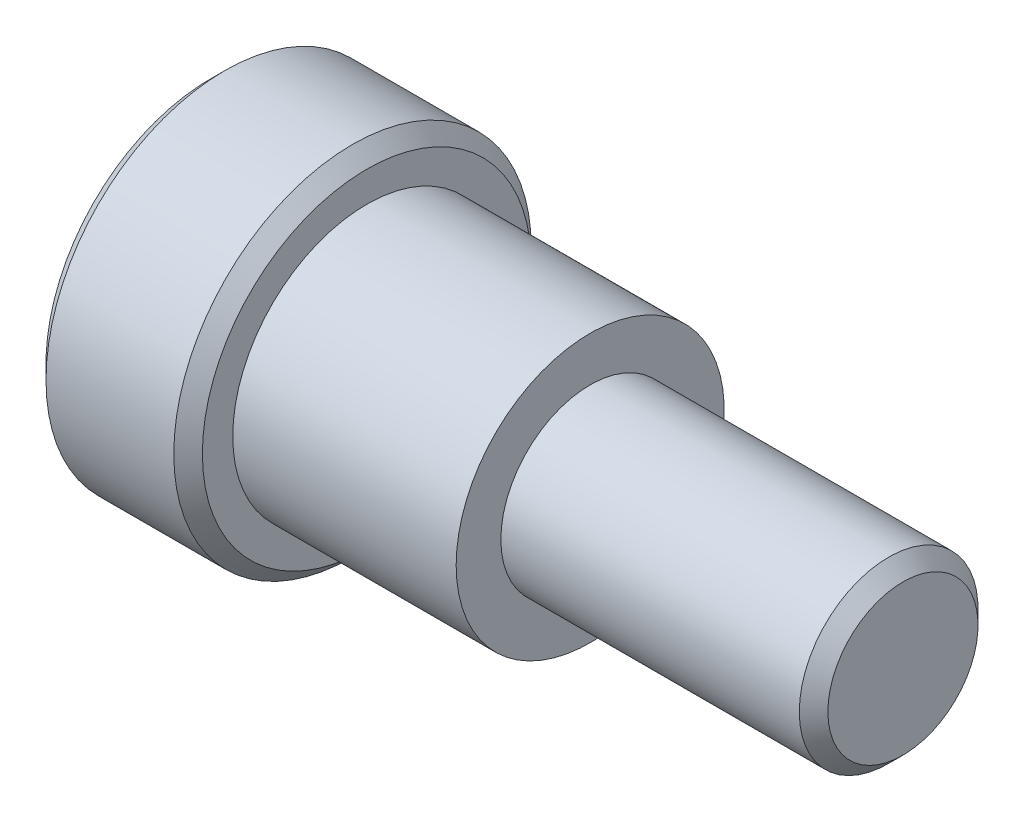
from build123d import *

# Parameters (mm, degrees)
CHAMFER1_SIZE      = 0.508
CUT_EXTRUDE1_DEPTH = 4.7752


with BuildPart() as part:
    # Sketch1 → Base-Revolve (revolve)
    with BuildSketch(Plane.XY, mode=Mode.PRIVATE) as base_revolve_sk:
        Polygon((0, 6.35), (5.55625, 6.35), (5.55625, 4.7625), (13.49375, 4.7625), (13.49375, 3.175), (24.60625, 3.175), (24.60625, 0), (0, 0), align=None)
    revolve(base_revolve_sk.sketch.rotate(Axis((0, 0, 0), (1, 0, 0)), 90), axis=Axis((0, 0, 0), (1, 0, 0)))

    # Chamfer1
    chamfer1_edges = [part.edges().sort_by_distance(p)[0] for p in [
        (24.60625, 0, -3.175),
        (5.55625, 0, -6.35),
        (0, 0, -6.35),
    ]]
    chamfer(chamfer1_edges, length=CHAMFER1_SIZE)

    # Hexagon - circumscribed1 → Cut-Extrude1 (cut)
    with BuildSketch(Plane(origin=(0, 0.026062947, -0.026062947), x_dir=(0, 0, 1), z_dir=(-1, 0, 0))):
        Polygon((-1.119616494, 1.958312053), (1.171742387, 1.958312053), (2.317421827, -0.026062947), (1.171742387, -2.010437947), (-1.119616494, -2.010437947), (-2.265295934, -0.026062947), align=None)
    extrude(amount=-CUT_EXTRUDE1_DEPTH, mode=Mode.SUBTRACT)


solid = part.part
